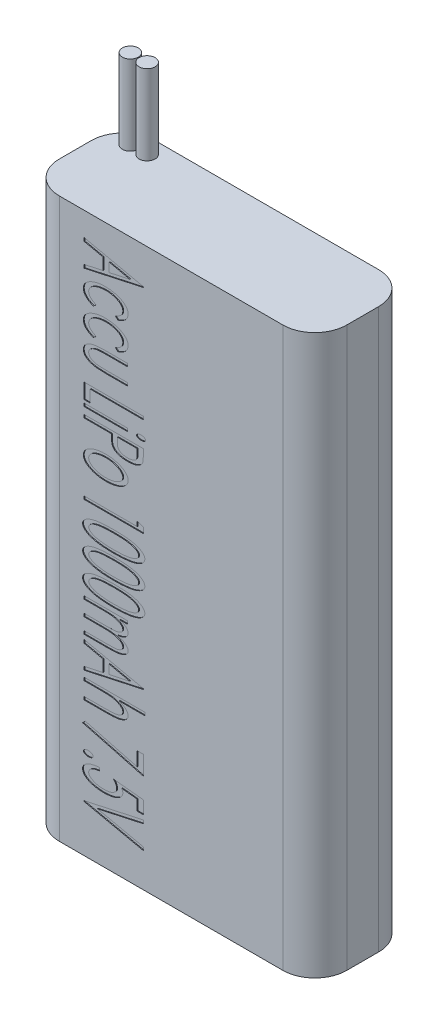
from build123d import *

# Parameters (mm, degrees)
EXTRUSION1_DEPTH        = 70
ESQUISSE2_W             = 5.413782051
ESQUISSE2_H             = 0.37991453
ENL_V_MAT_EXTRU_1_DEPTH = 0.1
ESQUISSE3_R             = 1
EXTRUSION2_DEPTH        = 10


with BuildPart() as part:
    # Esquisse1 → Extrusion1 (new body)
    with BuildSketch(Plane(origin=(0, 0, 0), x_dir=(1, 0, 0), z_dir=(0, 1, 0))):
        with BuildLine():
            Line((-14, 0), (14, 0))
            ThreePointArc((14, 0), (16.828427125, -1.171572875), (18, -4))
            Line((18, -4), (18, -8))
            ThreePointArc((18, -8), (16.828427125, -10.828427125), (14, -12))
            Line((14, -12), (-14, -12))
            ThreePointArc((-14, -12), (-16.828427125, -10.828427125), (-18, -8))
            Line((-18, -8), (-18, -4))
            ThreePointArc((-18, -4), (-16.828427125, -1.171572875), (-14, 0))
        make_face()
    extrude(amount=EXTRUSION1_DEPTH)

    # Esquisse2 → Enl_v. mat.-Extru.1 (cut)
    # profile 1 of 20: a face of its own
    with BuildSketch(Plane.XY.offset(12)):
        Polygon((-3.479233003, 65.32652701), (-10.887566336, 63.711890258), (-10.887566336, 64.122969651), (-8.513100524, 64.640900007), (-8.513100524, 66.107132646), (-10.887566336, 66.625063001), (-10.887566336, 67.036142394), (-3.479233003, 65.421505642), align=None)
        Polygon((-5.147295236, 65.374016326), (-7.753271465, 65.94240408), (-7.753271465, 64.805628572), align=None, mode=Mode.SUBTRACT)
    # profile 2 of 20: a face of its own
    with BuildSketch(Plane.XY.offset(12)):
        with BuildLine():
            Line((-6.647660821, 60.197680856), (-6.993442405, 60.485584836))
            add(Edge.make_bspline(
                [(-6.993442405, 60.485584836), (-6.918655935, 60.516454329), (-6.776324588, 60.575204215), (-6.581908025, 60.679160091), (-6.416645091, 60.791630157), (-6.281450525, 60.913754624), (-6.174584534, 61.044132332), (-6.098916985, 61.184519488), (-6.052021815, 61.33397975), (-6.046453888, 61.437020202), (-6.04365608, 61.488796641)],
                knots=[0, 0, 0, 0, 1.318688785, 2.509688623, 3.588184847, 4.570308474, 5.471048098, 6.322777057, 7.157218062, 8, 8, 8, 8], degree=3))
            add(Edge.make_bspline(
                [(-6.04365608, 61.488796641), (-6.045871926, 61.530485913), (-6.050249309, 61.612842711), (-6.07866726, 61.733791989), (-6.129580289, 61.847446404), (-6.196392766, 61.957552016), (-6.286106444, 62.060021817), (-6.393316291, 62.157756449), (-6.519374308, 62.250726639), (-6.664050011, 62.334665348), (-6.821509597, 62.413016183), (-6.989368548, 62.480922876), (-7.165322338, 62.538987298), (-7.34913708, 62.586758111), (-7.541796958, 62.621341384), (-7.742196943, 62.649025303), (-7.951442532, 62.662963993), (-8.093595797, 62.665723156), (-8.165834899, 62.6671253)],
                knots=[0, 0, 0, 0, 0.753257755, 1.488054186, 2.228480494, 2.994823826, 3.8061171, 4.678959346, 5.611944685, 6.629593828, 7.696658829, 8.786933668, 9.89752819, 11.041943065, 12.2145172, 13.431604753, 14.69479912, 16, 16, 16, 16], degree=3))
            add(Edge.make_bspline(
                [(-8.165834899, 62.6671253), (-8.260412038, 62.665760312), (-8.44708364, 62.663066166), (-8.722621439, 62.631249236), (-8.990414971, 62.585303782), (-9.245879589, 62.517384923), (-9.48320665, 62.433807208), (-9.697330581, 62.337708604), (-9.881376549, 62.222477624), (-10.036642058, 62.095309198), (-10.16237377, 61.957629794), (-10.251889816, 61.808472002), (-10.307363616, 61.649905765), (-10.314241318, 61.540673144), (-10.317694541, 61.485828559)],
                knots=[0, 0, 0, 0, 1.267897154, 2.502511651, 3.715525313, 4.909665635, 6.042860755, 7.087836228, 8.050656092, 8.946052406, 9.773106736, 10.537766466, 11.265827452, 12, 12, 12, 12], degree=3))
            add(Edge.make_bspline(
                [(-10.317694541, 61.485828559), (-10.314902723, 61.435525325), (-10.309344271, 61.335372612), (-10.262134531, 61.189888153), (-10.185868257, 61.052576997), (-10.080039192, 60.922547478), (-9.944302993, 60.80057516), (-9.779275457, 60.686572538), (-9.584922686, 60.579708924), (-9.442680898, 60.51801544), (-9.367908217, 60.485584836)],
                knots=[0, 0, 0, 0, 0.822732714, 1.638044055, 2.479727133, 3.384906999, 4.371872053, 5.460313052, 6.664954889, 8, 8, 8, 8], degree=3))
            Line((-9.367908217, 60.485584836), (-9.732982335, 60.197680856))
            add(Edge.make_bspline(
                [(-9.732982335, 60.197680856), (-9.827325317, 60.231749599), (-10.008509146, 60.297177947), (-10.256963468, 60.424491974), (-10.472573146, 60.568580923), (-10.65537162, 60.728428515), (-10.801825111, 60.90378874), (-10.906619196, 61.093976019), (-10.970628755, 61.297271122), (-10.978549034, 61.437394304), (-10.982544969, 61.508089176)],
                knots=[0, 0, 0, 0, 1.24214492, 2.385514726, 3.449959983, 4.448882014, 5.385367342, 6.266089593, 7.125208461, 8, 8, 8, 8], degree=3))
            add(Edge.make_bspline(
                [(-10.982544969, 61.508089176), (-10.980566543, 61.562263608), (-10.976630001, 61.670056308), (-10.935501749, 61.827085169), (-10.873067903, 61.977606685), (-10.783795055, 62.119971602), (-10.668969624, 62.254319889), (-10.529934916, 62.382241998), (-10.365276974, 62.50239941), (-10.177878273, 62.613389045), (-9.972982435, 62.715080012), (-9.754903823, 62.803315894), (-9.526802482, 62.880239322), (-9.286751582, 62.939821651), (-9.036821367, 62.989362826), (-8.775576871, 63.023337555), (-8.503982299, 63.042143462), (-8.319214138, 63.045388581), (-8.225196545, 63.04703983)],
                knots=[0, 0, 0, 0, 0.750373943, 1.493044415, 2.23771153, 3.005504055, 3.814258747, 4.683928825, 5.621819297, 6.637965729, 7.703410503, 8.793500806, 9.900774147, 11.041430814, 12.223647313, 13.435476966, 14.695065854, 16, 16, 16, 16], degree=3))
            add(Edge.make_bspline(
                [(-8.225196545, 63.04703983), (-8.098483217, 63.044232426), (-7.84896256, 63.038704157), (-7.481009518, 63.00220992), (-7.127642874, 62.935968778), (-6.791445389, 62.848411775), (-6.479610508, 62.739330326), (-6.200996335, 62.607450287), (-5.957345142, 62.457485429), (-5.782762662, 62.314276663), (-5.663628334, 62.191902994), (-5.587427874, 62.098151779), (-5.52346404, 62.001615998), (-5.470787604, 61.902237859), (-5.428659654, 61.80064828), (-5.401295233, 61.695640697), (-5.381909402, 61.588940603), (-5.379850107, 61.516588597), (-5.378805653, 61.479892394)],
                knots=[0, 0, 0, 0, 1.711411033, 3.370067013, 4.987107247, 6.562254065, 8.058366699, 9.442010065, 10.717465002, 11.9133582, 12.480344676, 13.021882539, 13.542577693, 14.041694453, 14.539198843, 15.023795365, 15.504878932, 16, 16, 16, 16], degree=3))
            add(Edge.make_bspline(
                [(-5.378805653, 61.479892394), (-5.380742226, 61.433690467), (-5.384618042, 61.341222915), (-5.418283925, 61.204675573), (-5.46804781, 61.069536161), (-5.542118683, 60.940212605), (-5.630337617, 60.816572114), (-5.732293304, 60.701158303), (-5.846753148, 60.595882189), (-5.974368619, 60.499719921), (-6.117568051, 60.413397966), (-6.277000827, 60.332817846), (-6.455607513, 60.260687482), (-6.58210097, 60.219188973), (-6.647660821, 60.197680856)],
                knots=[0, 0, 0, 0, 0.860282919, 1.72175189, 2.609200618, 3.538290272, 4.490491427, 5.43807946, 6.404208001, 7.38567114, 8.412385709, 9.517951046, 10.713587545, 12, 12, 12, 12], degree=3))
        make_face()
    # profile 3 of 20: a face of its own
    with BuildSketch(Plane.XY.offset(12)):
        with BuildLine():
            Line((-6.647660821, 56.778450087), (-6.993442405, 57.066354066))
            add(Edge.make_bspline(
                [(-6.993442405, 57.066354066), (-6.918655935, 57.09722356), (-6.776324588, 57.155973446), (-6.581908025, 57.259929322), (-6.416645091, 57.372399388), (-6.281450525, 57.494523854), (-6.174584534, 57.624901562), (-6.098916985, 57.765288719), (-6.052021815, 57.91474898), (-6.046453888, 58.017789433), (-6.04365608, 58.069565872)],
                knots=[0, 0, 0, 0, 1.318688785, 2.509688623, 3.588184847, 4.570308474, 5.471048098, 6.322777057, 7.157218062, 8, 8, 8, 8], degree=3))
            add(Edge.make_bspline(
                [(-6.04365608, 58.069565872), (-6.045871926, 58.111255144), (-6.050249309, 58.193611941), (-6.07866726, 58.31456122), (-6.129580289, 58.428215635), (-6.196392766, 58.538321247), (-6.286106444, 58.640791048), (-6.393316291, 58.738525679), (-6.519374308, 58.83149587), (-6.664050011, 58.915434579), (-6.821509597, 58.993785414), (-6.989368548, 59.061692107), (-7.165322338, 59.119756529), (-7.34913708, 59.167527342), (-7.541796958, 59.202110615), (-7.742196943, 59.229794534), (-7.951442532, 59.243733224), (-8.093595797, 59.246492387), (-8.165834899, 59.247894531)],
                knots=[0, 0, 0, 0, 0.753257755, 1.488054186, 2.228480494, 2.994823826, 3.8061171, 4.678959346, 5.611944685, 6.629593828, 7.696658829, 8.786933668, 9.89752819, 11.041943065, 12.2145172, 13.431604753, 14.69479912, 16, 16, 16, 16], degree=3))
            add(Edge.make_bspline(
                [(-8.165834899, 59.247894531), (-8.260412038, 59.246529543), (-8.44708364, 59.243835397), (-8.722621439, 59.212018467), (-8.990414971, 59.166073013), (-9.245879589, 59.098154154), (-9.48320665, 59.014576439), (-9.697330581, 58.918477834), (-9.881376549, 58.803246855), (-10.036642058, 58.676078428), (-10.16237377, 58.538399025), (-10.251889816, 58.389241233), (-10.307363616, 58.230674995), (-10.314241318, 58.121442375), (-10.317694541, 58.06659779)],
                knots=[0, 0, 0, 0, 1.267897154, 2.502511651, 3.715525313, 4.909665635, 6.042860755, 7.087836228, 8.050656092, 8.946052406, 9.773106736, 10.537766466, 11.265827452, 12, 12, 12, 12], degree=3))
            add(Edge.make_bspline(
                [(-10.317694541, 58.06659779), (-10.314902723, 58.016294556), (-10.309344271, 57.916141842), (-10.262134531, 57.770657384), (-10.185868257, 57.633346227), (-10.080039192, 57.503316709), (-9.944302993, 57.38134439), (-9.779275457, 57.267341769), (-9.584922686, 57.160478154), (-9.442680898, 57.098784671), (-9.367908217, 57.066354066)],
                knots=[0, 0, 0, 0, 0.822732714, 1.638044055, 2.479727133, 3.384906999, 4.371872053, 5.460313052, 6.664954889, 8, 8, 8, 8], degree=3))
            Line((-9.367908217, 57.066354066), (-9.732982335, 56.778450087))
            add(Edge.make_bspline(
                [(-9.732982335, 56.778450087), (-9.827325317, 56.81251883), (-10.008509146, 56.877947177), (-10.256963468, 57.005261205), (-10.472573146, 57.149350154), (-10.65537162, 57.309197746), (-10.801825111, 57.484557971), (-10.906619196, 57.674745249), (-10.970628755, 57.878040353), (-10.978549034, 58.018163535), (-10.982544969, 58.088858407)],
                knots=[0, 0, 0, 0, 1.24214492, 2.385514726, 3.449959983, 4.448882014, 5.385367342, 6.266089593, 7.125208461, 8, 8, 8, 8], degree=3))
            add(Edge.make_bspline(
                [(-10.982544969, 58.088858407), (-10.980566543, 58.143032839), (-10.976630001, 58.250825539), (-10.935501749, 58.4078544), (-10.873067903, 58.558375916), (-10.783795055, 58.700740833), (-10.668969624, 58.83508912), (-10.529934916, 58.963011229), (-10.365276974, 59.083168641), (-10.177878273, 59.194158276), (-9.972982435, 59.295849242), (-9.754903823, 59.384085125), (-9.526802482, 59.461008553), (-9.286751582, 59.520590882), (-9.036821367, 59.570132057), (-8.775576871, 59.604106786), (-8.503982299, 59.622912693), (-8.319214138, 59.626157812), (-8.225196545, 59.627809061)],
                knots=[0, 0, 0, 0, 0.750373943, 1.493044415, 2.23771153, 3.005504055, 3.814258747, 4.683928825, 5.621819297, 6.637965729, 7.703410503, 8.793500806, 9.900774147, 11.041430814, 12.223647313, 13.435476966, 14.695065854, 16, 16, 16, 16], degree=3))
            add(Edge.make_bspline(
                [(-8.225196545, 59.627809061), (-8.098483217, 59.625001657), (-7.84896256, 59.619473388), (-7.481009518, 59.582979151), (-7.127642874, 59.516738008), (-6.791445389, 59.429181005), (-6.479610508, 59.320099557), (-6.200996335, 59.188219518), (-5.957345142, 59.03825466), (-5.782762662, 58.895045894), (-5.663628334, 58.772672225), (-5.587427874, 58.67892101), (-5.52346404, 58.582385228), (-5.470787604, 58.48300709), (-5.428659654, 58.381417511), (-5.401295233, 58.276409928), (-5.381909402, 58.169709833), (-5.379850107, 58.097357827), (-5.378805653, 58.060661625)],
                knots=[0, 0, 0, 0, 1.711411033, 3.370067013, 4.987107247, 6.562254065, 8.058366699, 9.442010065, 10.717465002, 11.9133582, 12.480344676, 13.021882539, 13.542577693, 14.041694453, 14.539198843, 15.023795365, 15.504878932, 16, 16, 16, 16], degree=3))
            add(Edge.make_bspline(
                [(-5.378805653, 58.060661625), (-5.380742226, 58.014459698), (-5.384618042, 57.921992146), (-5.418283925, 57.785444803), (-5.46804781, 57.650305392), (-5.542118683, 57.520981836), (-5.630337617, 57.397341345), (-5.732293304, 57.281927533), (-5.846753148, 57.17665142), (-5.974368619, 57.080489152), (-6.117568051, 56.994167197), (-6.277000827, 56.913587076), (-6.455607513, 56.841456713), (-6.58210097, 56.799958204), (-6.647660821, 56.778450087)],
                knots=[0, 0, 0, 0, 0.860282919, 1.72175189, 2.609200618, 3.538290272, 4.490491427, 5.43807946, 6.404208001, 7.38567114, 8.412385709, 9.517951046, 10.713587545, 12, 12, 12, 12], degree=3))
        make_face()
    # profile 4 of 20: a face of its own
    with BuildSketch(Plane.XY.offset(12)):
        with BuildLine():
            Line((-5.473784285, 56.113599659), (-5.473784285, 55.73368513))
            Line((-5.473784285, 55.73368513), (-7.984781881, 55.73368513))
            add(Edge.make_bspline(
                [(-7.984781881, 55.73368513), (-8.058487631, 55.73310273), (-8.19946873, 55.731988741), (-8.402325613, 55.731771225), (-8.587295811, 55.726038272), (-8.75458287, 55.722969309), (-8.9039651, 55.714983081), (-9.035096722, 55.706451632), (-9.148960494, 55.696391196), (-9.218537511, 55.687386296), (-9.250668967, 55.683227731)],
                knots=[0, 0, 0, 0, 1.395453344, 2.66916147, 3.840154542, 4.898800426, 5.836495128, 6.671894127, 7.386665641, 8, 8, 8, 8], degree=3))
            add(Edge.make_bspline(
                [(-9.250668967, 55.683227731), (-9.329166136, 55.668938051), (-9.478976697, 55.641666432), (-9.689284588, 55.578194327), (-9.872899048, 55.495185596), (-10.029648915, 55.39667111), (-10.156922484, 55.283885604), (-10.249920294, 55.158117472), (-10.307753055, 55.019550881), (-10.314371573, 54.922933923), (-10.317694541, 54.874425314)],
                knots=[0, 0, 0, 0, 1.317153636, 2.513766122, 3.617996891, 4.635678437, 5.561222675, 6.409424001, 7.201417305, 8, 8, 8, 8], degree=3))
            add(Edge.make_bspline(
                [(-10.317694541, 54.874425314), (-10.314241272, 54.825963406), (-10.30737619, 54.729621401), (-10.252198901, 54.591803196), (-10.161447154, 54.467815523), (-10.03737227, 54.359126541), (-9.887497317, 54.262534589), (-9.711577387, 54.186193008), (-9.516672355, 54.118617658), (-9.376781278, 54.091556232), (-9.304094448, 54.077495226)],
                knots=[0, 0, 0, 0, 0.830068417, 1.650171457, 2.508098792, 3.446144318, 4.46618376, 5.557020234, 6.73063773, 8, 8, 8, 8], degree=3))
            add(Edge.make_bspline(
                [(-9.304094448, 54.077495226), (-9.274429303, 54.073423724), (-9.20828678, 54.064345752), (-9.098039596, 54.052093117), (-8.965791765, 54.044180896), (-8.811445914, 54.036654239), (-8.635311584, 54.031091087), (-8.437441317, 54.026128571), (-8.218268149, 54.025724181), (-8.064919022, 54.02463758), (-7.984781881, 54.024069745)],
                knots=[0, 0, 0, 0, 0.543859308, 1.212609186, 2.01407225, 2.949571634, 4.019367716, 5.214651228, 6.544433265, 8, 8, 8, 8], degree=3))
            Line((-7.984781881, 54.024069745), (-5.473784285, 54.024069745))
            Line((-5.473784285, 54.024069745), (-5.473784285, 53.644155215))
            Line((-5.473784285, 53.644155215), (-8.109441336, 53.644155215))
            add(Edge.make_bspline(
                [(-8.109441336, 53.644155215), (-8.198987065, 53.644122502), (-8.372671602, 53.64405905), (-8.624952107, 53.652617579), (-8.860033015, 53.661995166), (-9.078236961, 53.677111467), (-9.278770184, 53.69556723), (-9.462211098, 53.720068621), (-9.628981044, 53.745351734), (-9.823845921, 53.788436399), (-10.043071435, 53.851708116), (-10.280949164, 53.943724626), (-10.487607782, 54.055798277), (-10.637842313, 54.163047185), (-10.740002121, 54.258337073), (-10.804976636, 54.333260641), (-10.859596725, 54.413566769), (-10.903476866, 54.498062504), (-10.94007563, 54.586127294), (-10.965080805, 54.678880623), (-10.980439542, 54.775958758), (-10.98183516, 54.842212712), (-10.982544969, 54.875909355)],
                knots=[0, 0, 0, 0, 1.559821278, 3.025457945, 4.396994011, 5.65812099, 6.835465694, 7.90436892, 8.881932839, 9.772726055, 11.379059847, 12.852907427, 14.20642971, 15.464726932, 16.056089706, 16.636552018, 17.188688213, 17.743775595, 18.292674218, 18.84669026, 19.41342873, 20, 20, 20, 20], degree=3))
            add(Edge.make_bspline(
                [(-10.982544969, 54.875909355), (-10.981848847, 54.909609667), (-10.980480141, 54.975870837), (-10.964850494, 55.073369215), (-10.940374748, 55.166763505), (-10.903449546, 55.255236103), (-10.859589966, 55.339722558), (-10.8050316, 55.420100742), (-10.739550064, 55.494987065), (-10.638398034, 55.592234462), (-10.487260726, 55.700637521), (-10.279465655, 55.814618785), (-10.03848057, 55.905860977), (-9.816905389, 55.969305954), (-9.61959167, 56.012518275), (-9.4493699, 56.037905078), (-9.261911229, 56.061909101), (-9.055993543, 56.08090375), (-8.8328103, 56.095590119), (-8.591317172, 56.105231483), (-8.332105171, 56.113686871), (-8.152981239, 56.113629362), (-8.060467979, 56.113599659)],
                knots=[0, 0, 0, 0, 0.577788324, 1.136040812, 1.689952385, 2.230632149, 2.777408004, 3.321276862, 3.893047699, 4.481402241, 5.725877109, 7.070648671, 8.538224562, 10.136816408, 11.02256744, 12.002259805, 13.088837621, 14.265454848, 15.550045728, 16.926486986, 18.412603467, 20, 20, 20, 20], degree=3))
            Line((-8.060467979, 56.113599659), (-5.473784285, 56.113599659))
        make_face()
    # profile 5 of 20: a face of its own
    with BuildSketch(Plane.XY.offset(12)):
        Polygon((-3.479233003, 51.364668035), (-3.479233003, 50.984753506), (-10.127737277, 50.984753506), (-10.127737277, 49.465095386), (-10.887566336, 49.465095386), (-10.887566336, 51.364668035), align=None)
    # profile 6 of 20: a face of its own
    with BuildSketch(Plane.XY.offset(12)):
        with BuildLine():
            add(Edge.make_bspline(
                [(-3.194297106, 48.896707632), (-3.196270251, 48.876953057), (-3.200275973, 48.836848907), (-3.236313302, 48.781577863), (-3.291353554, 48.73358127), (-3.36363949, 48.689652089), (-3.451261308, 48.655477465), (-3.54859257, 48.62835276), (-3.655433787, 48.614228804), (-3.729012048, 48.611632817), (-3.767136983, 48.610287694)],
                knots=[0, 0, 0, 0, 0.677840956, 1.376098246, 2.211551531, 3.194432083, 4.284065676, 5.454375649, 6.68097232, 8, 8, 8, 8], degree=3))
            add(Edge.make_bspline(
                [(-3.767136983, 48.610287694), (-3.804270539, 48.611655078), (-3.876364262, 48.614309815), (-3.981266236, 48.628302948), (-4.077492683, 48.655753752), (-4.164705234, 48.689628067), (-4.236982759, 48.733586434), (-4.292024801, 48.781576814), (-4.328061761, 48.836849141), (-4.332067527, 48.876953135), (-4.334040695, 48.896707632)],
                knots=[0, 0, 0, 0, 1.295810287, 2.515778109, 3.679425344, 4.778344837, 5.769601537, 6.61217459, 7.316382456, 8, 8, 8, 8], degree=3))
            add(Edge.make_bspline(
                [(-4.334040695, 48.896707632), (-4.331977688, 48.915934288), (-4.327735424, 48.955471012), (-4.292400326, 49.010237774), (-4.236818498, 49.056948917), (-4.163962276, 49.098774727), (-4.077929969, 49.135232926), (-3.98119331, 49.161974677), (-3.876384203, 49.176183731), (-3.804277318, 49.178807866), (-3.767136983, 49.180159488)],
                knots=[0, 0, 0, 0, 0.669220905, 1.376152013, 2.210377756, 3.196534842, 4.30634595, 5.474493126, 6.699178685, 8, 8, 8, 8], degree=3))
            add(Edge.make_bspline(
                [(-3.767136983, 49.180159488), (-3.729005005, 49.178830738), (-3.655413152, 49.176266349), (-3.548666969, 49.161921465), (-3.450819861, 49.135519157), (-3.364381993, 49.098751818), (-3.29151793, 49.05695378), (-3.235937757, 49.010236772), (-3.200602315, 48.95547123), (-3.196360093, 48.91593436), (-3.194297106, 48.896707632)],
                knots=[0, 0, 0, 0, 1.324085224, 2.555385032, 3.730182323, 4.830579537, 5.808371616, 6.635521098, 7.336455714, 8, 8, 8, 8], degree=3))
        make_face()
    # profile 7 of 20: a face of its own
    with BuildSketch(Plane.XY.offset(12)):
        with Locations((-8.18067531, 48.895223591)):
            Rectangle(ESQUISSE2_W, ESQUISSE2_H)
    # profile 8 of 20: a face of its own
    with BuildSketch(Plane.XY.offset(12)):
        with BuildLine():
            Line((-3.479233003, 47.850458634), (-3.479233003, 47.093597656))
            add(Edge.make_bspline(
                [(-3.479233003, 47.093597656), (-3.479351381, 47.041648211), (-3.479579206, 46.941668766), (-3.485891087, 46.798672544), (-3.494430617, 46.668978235), (-3.506440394, 46.552688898), (-3.520256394, 46.448897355), (-3.539704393, 46.358824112), (-3.560954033, 46.281248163), (-3.581116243, 46.23612635), (-3.590536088, 46.215045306)],
                knots=[0, 0, 0, 0, 1.398759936, 2.691987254, 3.853659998, 4.898142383, 5.840073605, 6.670897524, 7.379039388, 8, 8, 8, 8], degree=3))
            add(Edge.make_bspline(
                [(-3.590536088, 46.215045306), (-3.60471127, 46.187931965), (-3.633344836, 46.133163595), (-3.689312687, 46.057277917), (-3.755415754, 45.985624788), (-3.831629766, 45.917344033), (-3.917681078, 45.851832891), (-4.015082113, 45.791351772), (-4.121831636, 45.733221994), (-4.281539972, 45.661085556), (-4.502994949, 45.583806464), (-4.796641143, 45.521819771), (-5.121032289, 45.483094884), (-5.348016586, 45.478426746), (-5.466364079, 45.475992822)],
                knots=[0, 0, 0, 0, 0.521432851, 1.053283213, 1.602921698, 2.182653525, 2.797168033, 3.445863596, 4.137047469, 4.869860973, 6.434205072, 8.127989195, 9.981169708, 12, 12, 12, 12], degree=3))
            add(Edge.make_bspline(
                [(-5.466364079, 45.475992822), (-5.585170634, 45.478637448), (-5.812524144, 45.483698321), (-6.137826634, 45.519495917), (-6.429958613, 45.583509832), (-6.652002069, 45.655634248), (-6.809226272, 45.729620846), (-6.916971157, 45.784966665), (-7.013981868, 45.847469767), (-7.099737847, 45.915871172), (-7.176343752, 45.98769439), (-7.24404664, 46.063385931), (-7.300704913, 46.145539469), (-7.331377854, 46.203837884), (-7.346644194, 46.232853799)],
                knots=[0, 0, 0, 0, 2.009965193, 3.846358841, 5.525688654, 7.063326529, 7.782279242, 8.463618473, 9.111281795, 9.730811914, 10.316938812, 10.886152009, 11.445622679, 12, 12, 12, 12], degree=3))
            add(Edge.make_bspline(
                [(-7.346644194, 46.232853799), (-7.356490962, 46.256436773), (-7.377866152, 46.307630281), (-7.40209903, 46.393773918), (-7.422883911, 46.493927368), (-7.438305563, 46.608069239), (-7.451565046, 46.735759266), (-7.462113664, 46.877272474), (-7.467883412, 47.033197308), (-7.468180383, 47.142071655), (-7.468335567, 47.198964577)],
                knots=[0, 0, 0, 0, 0.625646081, 1.358141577, 2.187676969, 3.130342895, 4.178300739, 5.332762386, 6.606219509, 8, 8, 8, 8], degree=3))
            Line((-7.468335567, 47.198964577), (-7.468335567, 47.470544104))
            Line((-7.468335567, 47.470544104), (-10.887566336, 47.470544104))
            Line((-10.887566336, 47.470544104), (-10.887566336, 47.850458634))
            Line((-10.887566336, 47.850458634), (-3.479233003, 47.850458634))
        make_face()
        with BuildLine():
            Line((-4.239062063, 47.470544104), (-6.708506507, 47.470544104))
            Line((-6.708506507, 47.470544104), (-6.72483096, 46.822018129))
            add(Edge.make_bspline(
                [(-6.72483096, 46.822018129), (-6.723351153, 46.76055602), (-6.72060345, 46.646433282), (-6.695119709, 46.487887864), (-6.656275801, 46.354028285), (-6.594174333, 46.244136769), (-6.510939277, 46.15567277), (-6.410108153, 46.077483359), (-6.287193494, 46.011739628), (-6.145974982, 45.956359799), (-5.991185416, 45.910453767), (-5.824334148, 45.880868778), (-5.650010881, 45.858216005), (-5.530257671, 45.856685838), (-5.469332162, 45.855907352)],
                knots=[0, 0, 0, 0, 1.212185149, 2.250783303, 3.161794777, 3.949014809, 4.716177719, 5.544300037, 6.457610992, 7.456672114, 8.535037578, 9.638096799, 10.798360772, 12, 12, 12, 12], degree=3))
            add(Edge.make_bspline(
                [(-5.469332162, 45.855907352), (-5.40988897, 45.856696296), (-5.292599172, 45.858252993), (-5.12126917, 45.881010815), (-4.956348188, 45.910407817), (-4.802666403, 45.95660774), (-4.663108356, 46.011341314), (-4.542419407, 46.07517953), (-4.442728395, 46.147153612), (-4.363852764, 46.232815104), (-4.305092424, 46.337587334), (-4.267169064, 46.466654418), (-4.241448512, 46.621149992), (-4.239897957, 46.733340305), (-4.239062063, 46.793821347)],
                knots=[0, 0, 0, 0, 1.199910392, 2.367592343, 3.486753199, 4.580869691, 5.603406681, 6.511074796, 7.332566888, 8.075402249, 8.845176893, 9.736467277, 10.779744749, 12, 12, 12, 12], degree=3))
            Line((-4.239062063, 46.793821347), (-4.239062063, 47.470544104))
        make_face(mode=Mode.SUBTRACT)
    # profile 9 of 20: a face of its own
    with BuildSketch(Plane.XY.offset(12)):
        with BuildLine():
            add(Edge.make_bspline(
                [(-5.378805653, 43.432468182), (-5.381087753, 43.379223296), (-5.385644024, 43.272918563), (-5.431616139, 43.118379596), (-5.50215624, 42.971066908), (-5.600915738, 42.830711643), (-5.72862385, 42.699180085), (-5.883177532, 42.573962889), (-6.065794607, 42.456533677), (-6.200297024, 42.387977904), (-6.270714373, 42.352086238)],
                knots=[0, 0, 0, 0, 0.86112124, 1.719249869, 2.590875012, 3.500801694, 4.487759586, 5.553635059, 6.719230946, 8, 8, 8, 8], degree=3))
            add(Edge.make_bspline(
                [(-6.270714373, 42.352086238), (-6.339518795, 42.32032611), (-6.478542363, 42.256152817), (-6.697151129, 42.179287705), (-6.923812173, 42.111620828), (-7.160284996, 42.056971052), (-7.4060678, 42.01441682), (-7.661063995, 41.9827822), (-7.925167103, 41.965193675), (-8.104469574, 41.962931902), (-8.195515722, 41.96178342)],
                knots=[0, 0, 0, 0, 0.91795664, 1.854787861, 2.805160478, 3.783872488, 4.794154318, 5.827041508, 6.896615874, 8, 8, 8, 8], degree=3))
            add(Edge.make_bspline(
                [(-8.195515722, 41.96178342), (-8.287064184, 41.962792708), (-8.467404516, 41.964780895), (-8.733463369, 41.98440513), (-8.990899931, 42.017462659), (-9.239889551, 42.061023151), (-9.48018215, 42.119392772), (-9.711092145, 42.190353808), (-9.933732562, 42.273875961), (-10.144829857, 42.368728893), (-10.339309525, 42.473441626), (-10.509895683, 42.58815287), (-10.655601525, 42.709355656), (-10.773807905, 42.839628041), (-10.868767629, 42.975811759), (-10.934253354, 43.121263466), (-10.974923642, 43.274449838), (-10.979979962, 43.379286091), (-10.982544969, 43.432468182)],
                knots=[0, 0, 0, 0, 1.278164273, 2.517842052, 3.72244268, 4.901239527, 6.045490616, 7.172897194, 8.272386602, 9.363687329, 10.402278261, 11.352514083, 12.229860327, 13.041587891, 13.8021844, 14.537909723, 15.258300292, 16, 16, 16, 16], degree=3))
            add(Edge.make_bspline(
                [(-10.982544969, 43.432468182), (-10.97992331, 43.485634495), (-10.974731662, 43.590919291), (-10.934617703, 43.744783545), (-10.868325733, 43.890820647), (-10.77428569, 44.028073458), (-10.65598992, 44.158558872), (-10.509370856, 44.278128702), (-10.339376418, 44.393039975), (-10.144863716, 44.497823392), (-9.933351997, 44.591988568), (-9.711757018, 44.678547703), (-9.479601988, 44.745955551), (-9.24019184, 44.807565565), (-8.990848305, 44.850246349), (-8.733477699, 44.883553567), (-8.467400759, 44.90310933), (-8.287062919, 44.90510695), (-8.195515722, 44.906121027)],
                knots=[0, 0, 0, 0, 0.741234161, 1.46785969, 2.203123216, 2.968956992, 3.780175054, 4.652530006, 5.602169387, 6.640108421, 7.730724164, 8.83197098, 9.956659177, 11.101836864, 12.279893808, 13.483738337, 14.722638, 16, 16, 16, 16], degree=3))
            add(Edge.make_bspline(
                [(-8.195515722, 44.906121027), (-8.104964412, 44.904964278), (-7.92615703, 44.902680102), (-7.662549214, 44.885108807), (-7.408031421, 44.853596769), (-7.163217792, 44.811016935), (-6.927426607, 44.755741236), (-6.700901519, 44.689248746), (-6.482635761, 44.611371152), (-6.343992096, 44.547516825), (-6.275166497, 44.515818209)],
                knots=[0, 0, 0, 0, 1.099813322, 2.17174928, 3.206917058, 4.213511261, 5.18853308, 6.146766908, 7.080016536, 8, 8, 8, 8], degree=3))
            add(Edge.make_bspline(
                [(-6.275166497, 44.515818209), (-6.204192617, 44.480025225), (-6.068982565, 44.411837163), (-5.886098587, 44.293387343), (-5.730140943, 44.169271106), (-5.602111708, 44.036534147), (-5.502370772, 43.896043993), (-5.431637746, 43.748024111), (-5.385496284, 43.593027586), (-5.381045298, 43.486214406), (-5.378805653, 43.432468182)],
                knots=[0, 0, 0, 0, 1.282648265, 2.443531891, 3.511299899, 4.494267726, 5.41164008, 6.279741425, 7.134400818, 8, 8, 8, 8], degree=3))
        make_face()
        with BuildLine():
            add(Edge.make_bspline(
                [(-6.04365608, 43.433952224), (-6.045763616, 43.470755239), (-6.049989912, 43.544557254), (-6.081123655, 43.65263921), (-6.130945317, 43.756288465), (-6.200457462, 43.855652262), (-6.291410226, 43.948915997), (-6.400148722, 44.039680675), (-6.529475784, 44.125701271), (-6.675960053, 44.207286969), (-6.836543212, 44.282418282), (-7.007263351, 44.347580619), (-7.186016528, 44.401877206), (-7.37234309, 44.449265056), (-7.568095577, 44.481905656), (-7.771579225, 44.507029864), (-7.982993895, 44.524587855), (-8.1267187, 44.525660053), (-8.199967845, 44.526206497)],
                knots=[0, 0, 0, 0, 0.673132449, 1.349849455, 2.042497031, 2.771037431, 3.558905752, 4.420412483, 5.359790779, 6.397715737, 7.487520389, 8.602580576, 9.739779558, 10.90606597, 12.119462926, 13.369644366, 14.659442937, 16, 16, 16, 16], degree=3))
            add(Edge.make_bspline(
                [(-8.199967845, 44.526206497), (-8.294526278, 44.524674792), (-8.481109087, 44.521652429), (-8.755809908, 44.492364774), (-9.020646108, 44.446691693), (-9.272524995, 44.384136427), (-9.505002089, 44.304406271), (-9.714546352, 44.214504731), (-9.894044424, 44.106776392), (-10.044911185, 43.98877224), (-10.165743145, 43.861452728), (-10.252589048, 43.725217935), (-10.308753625, 43.582122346), (-10.314740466, 43.482907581), (-10.317694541, 43.433952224)],
                knots=[0, 0, 0, 0, 1.312767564, 2.590354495, 3.831574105, 5.042871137, 6.189932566, 7.241788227, 8.203159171, 9.088289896, 9.895184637, 10.627029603, 11.322537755, 12, 12, 12, 12], degree=3))
            add(Edge.make_bspline(
                [(-10.317694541, 43.433952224), (-10.314735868, 43.385000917), (-10.308739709, 43.285794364), (-10.252647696, 43.142634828), (-10.165303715, 43.006358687), (-10.045433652, 42.877695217), (-9.894379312, 42.759508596), (-9.714079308, 42.653711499), (-9.505073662, 42.563372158), (-9.2725039, 42.483805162), (-9.020652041, 42.421202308), (-8.755808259, 42.375542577), (-8.481109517, 42.346251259), (-8.294526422, 42.3432294), (-8.199967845, 42.34169795)],
                knots=[0, 0, 0, 0, 0.677376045, 1.3727957, 2.104547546, 2.91638239, 3.801400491, 4.75913322, 5.810855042, 6.957770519, 8.168913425, 9.409975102, 10.687399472, 12, 12, 12, 12], degree=3))
            add(Edge.make_bspline(
                [(-8.199967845, 42.34169795), (-8.126715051, 42.342226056), (-7.982983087, 42.343262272), (-7.771620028, 42.361079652), (-7.56786332, 42.385274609), (-7.372807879, 42.421263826), (-7.185457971, 42.464962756), (-7.007591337, 42.522404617), (-6.836491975, 42.586799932), (-6.675980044, 42.6621513), (-6.529447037, 42.743652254), (-6.400232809, 42.829790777), (-6.290859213, 42.920437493), (-6.200870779, 43.015140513), (-6.131311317, 43.11424708), (-6.081112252, 43.216688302), (-6.049854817, 43.323805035), (-6.045727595, 43.397142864), (-6.04365608, 43.433952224)],
                knots=[0, 0, 0, 0, 1.341240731, 2.631697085, 3.882516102, 5.098119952, 6.262853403, 7.403334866, 8.518963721, 9.60932416, 10.647778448, 11.587635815, 12.449581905, 13.244437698, 13.973349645, 14.658187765, 15.326524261, 16, 16, 16, 16], degree=3))
        make_face(mode=Mode.SUBTRACT)
    # profile 10 of 20: a face of its own
    with BuildSketch(Plane.XY.offset(12)):
        Polygon((-3.479233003, 39.370647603), (-3.479233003, 38.637531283), (-10.887566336, 38.637531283), (-10.887566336, 39.017445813), (-4.239062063, 39.017445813), (-4.239062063, 39.587317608), align=None)
    # profile 11 of 20: a face of its own
    with BuildSketch(Plane.XY.offset(12)):
        with BuildLine():
            add(Edge.make_bspline(
                [(-7.186367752, 37.212851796), (-7.06763952, 37.212222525), (-6.837085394, 37.211000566), (-6.501170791, 37.203283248), (-6.185941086, 37.192350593), (-5.891600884, 37.173997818), (-5.618331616, 37.152671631), (-5.366014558, 37.124197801), (-5.134332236, 37.092006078), (-4.921980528, 37.05481923), (-4.726064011, 37.012822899), (-4.543652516, 36.967574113), (-4.373862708, 36.915969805), (-4.21484996, 36.864413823), (-4.069544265, 36.803824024), (-3.935406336, 36.742685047), (-3.814349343, 36.674939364), (-3.704749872, 36.604728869), (-3.608142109, 36.529952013), (-3.523119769, 36.454766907), (-3.450649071, 36.377347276), (-3.392326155, 36.296301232), (-3.345756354, 36.213370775), (-3.312783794, 36.127973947), (-3.292270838, 36.040447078), (-3.290277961, 35.981208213), (-3.289275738, 35.951416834)],
                knots=[0, 0, 0, 0, 1.9498248, 3.786295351, 5.517924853, 7.129425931, 8.629198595, 10.018875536, 11.298758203, 12.470106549, 13.558387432, 14.588885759, 15.555333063, 16.472480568, 17.332396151, 18.13925172, 18.892025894, 19.608596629, 20.274813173, 20.896178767, 21.471090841, 22.012236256, 22.532234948, 23.028596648, 23.511478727, 24, 24, 24, 24], degree=3))
            add(Edge.make_bspline(
                [(-3.289275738, 35.951416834), (-3.290271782, 35.921128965), (-3.292252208, 35.860907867), (-3.312845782, 35.771965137), (-3.345271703, 35.685277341), (-3.393219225, 35.601706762), (-3.449979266, 35.518159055), (-3.523197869, 35.439295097), (-3.608146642, 35.361942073), (-3.706152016, 35.286871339), (-3.816486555, 35.213184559), (-3.941194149, 35.145912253), (-4.078349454, 35.082495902), (-4.227402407, 35.020670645), (-4.390533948, 34.965712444), (-4.565902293, 34.911567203), (-4.754666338, 34.863036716), (-4.957102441, 34.818454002), (-5.174893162, 34.77842319), (-5.409411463, 34.742721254), (-5.661865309, 34.713286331), (-5.93214436, 34.690235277), (-6.220550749, 34.6705379), (-6.526856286, 34.657583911), (-6.850939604, 34.650416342), (-7.07258768, 34.649102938), (-7.186367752, 34.648428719)],
                knots=[0, 0, 0, 0, 0.494963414, 0.98413135, 1.486391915, 2.004648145, 2.557189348, 3.136150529, 3.760862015, 4.436202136, 5.154810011, 5.930241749, 6.752492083, 7.627579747, 8.569870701, 9.568763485, 10.631199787, 11.758832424, 12.961004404, 14.254967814, 15.640910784, 17.120205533, 18.694500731, 20.372114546, 22.13767358, 24, 24, 24, 24], degree=3))
            add(Edge.make_bspline(
                [(-7.186367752, 34.648428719), (-7.299653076, 34.649103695), (-7.520311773, 34.650418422), (-7.84291257, 34.65757329), (-8.147730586, 34.670568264), (-8.434667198, 34.690119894), (-8.703359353, 34.713657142), (-8.954849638, 34.74146254), (-9.188610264, 34.774912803), (-9.405210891, 34.815658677), (-9.606291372, 34.859776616), (-9.793527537, 34.909560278), (-9.969567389, 34.960094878), (-10.131540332, 35.019150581), (-10.282959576, 35.076814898), (-10.419272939, 35.143355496), (-10.544609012, 35.210558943), (-10.656037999, 35.283431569), (-10.754587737, 35.35955346), (-10.840907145, 35.437160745), (-10.912596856, 35.518498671), (-10.973235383, 35.600093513), (-11.019642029, 35.685082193), (-11.052086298, 35.772125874), (-11.074995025, 35.860703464), (-11.076678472, 35.921097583), (-11.077523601, 35.951416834)],
                knots=[0, 0, 0, 0, 1.856919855, 3.61693378, 5.288880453, 6.857369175, 8.33073272, 9.709704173, 11.004351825, 12.200295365, 13.321647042, 14.377778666, 15.375784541, 16.322121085, 17.202968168, 18.029877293, 18.806433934, 19.532858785, 20.209178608, 20.846251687, 21.432088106, 21.983526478, 22.50964327, 23.012632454, 23.504318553, 24, 24, 24, 24], degree=3))
            add(Edge.make_bspline(
                [(-11.077523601, 35.951416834), (-11.076519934, 35.981207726), (-11.074524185, 36.040445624), (-11.054032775, 36.12797975), (-11.021218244, 36.212719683), (-10.975583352, 36.294985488), (-10.919309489, 36.376382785), (-10.846572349, 36.452686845), (-10.763678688, 36.528602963), (-10.667887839, 36.601685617), (-10.559233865, 36.670749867), (-10.438806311, 36.738207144), (-10.304336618, 36.799765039), (-10.158613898, 36.859262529), (-9.999572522, 36.912133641), (-9.829053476, 36.963090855), (-9.645005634, 37.008051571), (-9.447830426, 37.051919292), (-9.234097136, 37.090885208), (-9.000771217, 37.122705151), (-8.747391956, 37.150648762), (-8.474295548, 37.174520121), (-8.180845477, 37.192188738), (-7.867116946, 37.20333271), (-7.533175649, 37.210975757), (-7.304106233, 37.212214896), (-7.186367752, 37.212851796)],
                knots=[0, 0, 0, 0, 0.489206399, 0.972765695, 1.469823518, 1.979503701, 2.516685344, 3.092403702, 3.708601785, 4.364345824, 5.070673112, 5.824503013, 6.632490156, 7.50114929, 8.411876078, 9.387477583, 10.427311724, 11.526792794, 12.709225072, 13.998958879, 15.398670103, 16.901229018, 18.506869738, 20.23279814, 22.063710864, 24, 24, 24, 24], degree=3))
        make_face()
        with BuildLine():
            add(Edge.make_bspline(
                [(-7.18339967, 36.832937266), (-7.28233996, 36.832816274), (-7.474304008, 36.832581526), (-7.75331581, 36.826104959), (-8.013556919, 36.817618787), (-8.254976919, 36.805573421), (-8.47773799, 36.791555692), (-8.682011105, 36.771816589), (-8.867833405, 36.750689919), (-9.083819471, 36.714951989), (-9.325385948, 36.667900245), (-9.583113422, 36.591531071), (-9.805405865, 36.506641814), (-9.98715303, 36.403890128), (-10.131019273, 36.29546604), (-10.236434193, 36.183005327), (-10.304205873, 36.063871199), (-10.313322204, 35.97984487), (-10.317694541, 35.939544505)],
                knots=[0, 0, 0, 0, 1.373741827, 2.665335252, 3.874915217, 4.988988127, 6.021568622, 6.973635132, 7.838372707, 8.617530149, 10.013095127, 11.25192517, 12.346280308, 13.30899082, 14.141540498, 14.836901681, 15.442159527, 16, 16, 16, 16], degree=3))
            add(Edge.make_bspline(
                [(-10.317694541, 35.939544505), (-10.314130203, 35.898629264), (-10.306775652, 35.814205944), (-10.236663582, 35.696813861), (-10.137490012, 35.581866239), (-9.994105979, 35.476999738), (-9.814779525, 35.376405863), (-9.592949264, 35.293376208), (-9.333629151, 35.218424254), (-9.145699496, 35.183452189), (-9.045871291, 35.164875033)],
                knots=[0, 0, 0, 0, 0.612834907, 1.264505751, 2.016446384, 2.900971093, 3.927663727, 5.11513031, 6.467557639, 8, 8, 8, 8], degree=3))
            add(Edge.make_bspline(
                [(-9.045871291, 35.164875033), (-8.97966491, 35.153449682), (-8.84463964, 35.130148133), (-8.63597484, 35.10478688), (-8.418398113, 35.080455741), (-8.190752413, 35.061439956), (-7.953255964, 35.046482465), (-7.705337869, 35.036898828), (-7.447616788, 35.028316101), (-7.27245009, 35.028334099), (-7.18339967, 35.028343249)],
                knots=[0, 0, 0, 0, 0.862252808, 1.758530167, 2.697450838, 3.672457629, 4.690394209, 5.75172757, 6.857033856, 8, 8, 8, 8], degree=3))
            add(Edge.make_bspline(
                [(-7.18339967, 35.028343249), (-7.094354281, 35.028515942), (-6.920199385, 35.028853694), (-6.66538491, 35.034755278), (-6.422987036, 35.045406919), (-6.19293465, 35.058719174), (-5.975143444, 35.074461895), (-5.76975851, 35.095167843), (-5.576841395, 35.120554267), (-5.395758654, 35.148808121), (-5.22662873, 35.178823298), (-5.070289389, 35.215913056), (-4.924542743, 35.251364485), (-4.791397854, 35.293819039), (-4.669131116, 35.336103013), (-4.559041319, 35.382075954), (-4.460644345, 35.430792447), (-4.349449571, 35.49763457), (-4.236013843, 35.586342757), (-4.128410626, 35.696560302), (-4.063221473, 35.816726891), (-4.053669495, 35.89983082), (-4.049104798, 35.939544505)],
                knots=[0, 0, 0, 0, 1.545659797, 3.023000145, 4.423949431, 5.757155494, 7.022953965, 8.214023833, 9.339820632, 10.400046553, 11.395419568, 12.320293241, 13.188756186, 13.998111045, 14.744970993, 15.433903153, 16.06753011, 16.64922297, 17.683254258, 18.558356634, 19.31106784, 20, 20, 20, 20], degree=3))
            add(Edge.make_bspline(
                [(-4.049104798, 35.939544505), (-4.053534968, 35.980283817), (-4.062689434, 36.064467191), (-4.128480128, 36.185422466), (-4.235533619, 36.295853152), (-4.377991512, 36.40410423), (-4.559236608, 36.505071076), (-4.78038912, 36.590614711), (-5.038969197, 36.663879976), (-5.279825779, 36.713828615), (-5.496018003, 36.74910783), (-5.681321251, 36.770367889), (-5.885654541, 36.789744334), (-6.108781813, 36.806138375), (-6.350783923, 36.817370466), (-6.611499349, 36.826220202), (-6.891012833, 36.832555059), (-7.083965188, 36.832807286), (-7.18339967, 36.832937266)],
                knots=[0, 0, 0, 0, 0.564503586, 1.166485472, 1.866349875, 2.689115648, 3.642294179, 4.736447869, 5.973125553, 7.369835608, 8.148849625, 9.01342802, 9.958482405, 10.998201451, 12.118928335, 13.321422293, 14.619643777, 16, 16, 16, 16], degree=3))
        make_face(mode=Mode.SUBTRACT)
    # profile 12 of 20: a face of its own
    with BuildSketch(Plane.XY.offset(12)):
        with BuildLine():
            add(Edge.make_bspline(
                [(-7.186367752, 34.268514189), (-7.06763952, 34.267884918), (-6.837085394, 34.266662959), (-6.501170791, 34.258945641), (-6.185941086, 34.248012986), (-5.891600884, 34.229660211), (-5.618331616, 34.208334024), (-5.366014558, 34.179860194), (-5.134332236, 34.147668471), (-4.921980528, 34.110481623), (-4.726064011, 34.068485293), (-4.543652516, 34.023236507), (-4.373862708, 33.971632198), (-4.21484996, 33.920076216), (-4.069544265, 33.859486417), (-3.935406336, 33.79834744), (-3.814349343, 33.730601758), (-3.704749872, 33.660391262), (-3.608142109, 33.585614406), (-3.523119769, 33.5104293), (-3.450649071, 33.433009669), (-3.392326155, 33.351963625), (-3.345756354, 33.269033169), (-3.312783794, 33.18363634), (-3.292270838, 33.096109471), (-3.290277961, 33.036870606), (-3.289275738, 33.007079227)],
                knots=[0, 0, 0, 0, 1.9498248, 3.786295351, 5.517924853, 7.129425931, 8.629198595, 10.018875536, 11.298758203, 12.470106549, 13.558387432, 14.588885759, 15.555333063, 16.472480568, 17.332396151, 18.13925172, 18.892025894, 19.608596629, 20.274813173, 20.896178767, 21.471090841, 22.012236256, 22.532234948, 23.028596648, 23.511478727, 24, 24, 24, 24], degree=3))
            add(Edge.make_bspline(
                [(-3.289275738, 33.007079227), (-3.290271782, 32.976791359), (-3.292252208, 32.91657026), (-3.312845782, 32.82762753), (-3.345271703, 32.740939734), (-3.393219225, 32.657369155), (-3.449979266, 32.573821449), (-3.523197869, 32.494957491), (-3.608146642, 32.417604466), (-3.706152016, 32.342533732), (-3.816486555, 32.268846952), (-3.941194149, 32.201574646), (-4.078349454, 32.138158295), (-4.227402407, 32.076333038), (-4.390533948, 32.021374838), (-4.565902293, 31.967229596), (-4.754666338, 31.918699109), (-4.957102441, 31.874116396), (-5.174893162, 31.834085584), (-5.409411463, 31.798383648), (-5.661865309, 31.768948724), (-5.93214436, 31.74589767), (-6.220550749, 31.726200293), (-6.526856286, 31.713246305), (-6.850939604, 31.706078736), (-7.07258768, 31.704765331), (-7.186367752, 31.704091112)],
                knots=[0, 0, 0, 0, 0.494963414, 0.98413135, 1.486391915, 2.004648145, 2.557189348, 3.136150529, 3.760862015, 4.436202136, 5.154810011, 5.930241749, 6.752492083, 7.627579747, 8.569870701, 9.568763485, 10.631199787, 11.758832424, 12.961004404, 14.254967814, 15.640910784, 17.120205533, 18.694500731, 20.372114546, 22.13767358, 24, 24, 24, 24], degree=3))
            add(Edge.make_bspline(
                [(-7.186367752, 31.704091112), (-7.299653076, 31.704766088), (-7.520311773, 31.706080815), (-7.84291257, 31.713235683), (-8.147730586, 31.726230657), (-8.434667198, 31.745782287), (-8.703359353, 31.769319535), (-8.954849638, 31.797124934), (-9.188610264, 31.830575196), (-9.405210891, 31.87132107), (-9.606291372, 31.915439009), (-9.793527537, 31.965222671), (-9.969567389, 32.015757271), (-10.131540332, 32.074812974), (-10.282959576, 32.132477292), (-10.419272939, 32.199017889), (-10.544609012, 32.266221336), (-10.656037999, 32.339093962), (-10.754587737, 32.415215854), (-10.840907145, 32.492823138), (-10.912596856, 32.574161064), (-10.973235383, 32.655755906), (-11.019642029, 32.740744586), (-11.052086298, 32.827788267), (-11.074995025, 32.916365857), (-11.076678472, 32.976759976), (-11.077523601, 33.007079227)],
                knots=[0, 0, 0, 0, 1.856919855, 3.61693378, 5.288880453, 6.857369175, 8.33073272, 9.709704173, 11.004351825, 12.200295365, 13.321647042, 14.377778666, 15.375784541, 16.322121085, 17.202968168, 18.029877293, 18.806433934, 19.532858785, 20.209178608, 20.846251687, 21.432088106, 21.983526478, 22.50964327, 23.012632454, 23.504318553, 24, 24, 24, 24], degree=3))
            add(Edge.make_bspline(
                [(-11.077523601, 33.007079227), (-11.076519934, 33.03687012), (-11.074524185, 33.096108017), (-11.054032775, 33.183642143), (-11.021218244, 33.268382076), (-10.975583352, 33.350647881), (-10.919309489, 33.432045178), (-10.846572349, 33.508349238), (-10.763678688, 33.584265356), (-10.667887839, 33.65734801), (-10.559233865, 33.72641226), (-10.438806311, 33.793869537), (-10.304336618, 33.855427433), (-10.158613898, 33.914924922), (-9.999572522, 33.967796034), (-9.829053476, 34.018753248), (-9.645005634, 34.063713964), (-9.447830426, 34.107581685), (-9.234097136, 34.146547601), (-9.000771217, 34.178367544), (-8.747391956, 34.206311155), (-8.474295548, 34.230182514), (-8.180845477, 34.247851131), (-7.867116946, 34.258995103), (-7.533175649, 34.26663815), (-7.304106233, 34.267877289), (-7.186367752, 34.268514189)],
                knots=[0, 0, 0, 0, 0.489206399, 0.972765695, 1.469823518, 1.979503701, 2.516685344, 3.092403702, 3.708601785, 4.364345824, 5.070673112, 5.824503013, 6.632490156, 7.50114929, 8.411876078, 9.387477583, 10.427311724, 11.526792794, 12.709225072, 13.998958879, 15.398670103, 16.901229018, 18.506869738, 20.23279814, 22.063710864, 24, 24, 24, 24], degree=3))
        make_face()
        with BuildLine():
            add(Edge.make_bspline(
                [(-7.18339967, 33.888599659), (-7.28233996, 33.888478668), (-7.474304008, 33.888243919), (-7.75331581, 33.881767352), (-8.013556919, 33.87328118), (-8.254976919, 33.861235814), (-8.47773799, 33.847218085), (-8.682011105, 33.827478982), (-8.867833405, 33.806352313), (-9.083819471, 33.770614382), (-9.325385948, 33.723562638), (-9.583113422, 33.647193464), (-9.805405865, 33.562304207), (-9.98715303, 33.459552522), (-10.131019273, 33.351128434), (-10.236434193, 33.23866772), (-10.304205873, 33.119533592), (-10.313322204, 33.035507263), (-10.317694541, 32.995206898)],
                knots=[0, 0, 0, 0, 1.373741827, 2.665335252, 3.874915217, 4.988988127, 6.021568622, 6.973635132, 7.838372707, 8.617530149, 10.013095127, 11.25192517, 12.346280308, 13.30899082, 14.141540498, 14.836901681, 15.442159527, 16, 16, 16, 16], degree=3))
            add(Edge.make_bspline(
                [(-10.317694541, 32.995206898), (-10.314130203, 32.954291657), (-10.306775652, 32.869868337), (-10.236663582, 32.752476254), (-10.137490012, 32.637528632), (-9.994105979, 32.532662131), (-9.814779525, 32.432068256), (-9.592949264, 32.349038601), (-9.333629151, 32.274086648), (-9.145699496, 32.239114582), (-9.045871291, 32.220537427)],
                knots=[0, 0, 0, 0, 0.612834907, 1.264505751, 2.016446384, 2.900971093, 3.927663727, 5.11513031, 6.467557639, 8, 8, 8, 8], degree=3))
            add(Edge.make_bspline(
                [(-9.045871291, 32.220537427), (-8.97966491, 32.209112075), (-8.84463964, 32.185810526), (-8.63597484, 32.160449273), (-8.418398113, 32.136118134), (-8.190752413, 32.117102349), (-7.953255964, 32.102144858), (-7.705337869, 32.092561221), (-7.447616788, 32.083978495), (-7.27245009, 32.083996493), (-7.18339967, 32.084005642)],
                knots=[0, 0, 0, 0, 0.862252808, 1.758530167, 2.697450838, 3.672457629, 4.690394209, 5.75172757, 6.857033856, 8, 8, 8, 8], degree=3))
            add(Edge.make_bspline(
                [(-7.18339967, 32.084005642), (-7.094354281, 32.084178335), (-6.920199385, 32.084516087), (-6.66538491, 32.090417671), (-6.422987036, 32.101069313), (-6.19293465, 32.114381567), (-5.975143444, 32.130124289), (-5.76975851, 32.150830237), (-5.576841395, 32.17621666), (-5.395758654, 32.204470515), (-5.22662873, 32.234485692), (-5.070289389, 32.271575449), (-4.924542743, 32.307026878), (-4.791397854, 32.349481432), (-4.669131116, 32.391765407), (-4.559041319, 32.437738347), (-4.460644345, 32.48645484), (-4.349449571, 32.553296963), (-4.236013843, 32.64200515), (-4.128410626, 32.752222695), (-4.063221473, 32.872389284), (-4.053669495, 32.955493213), (-4.049104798, 32.995206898)],
                knots=[0, 0, 0, 0, 1.545659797, 3.023000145, 4.423949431, 5.757155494, 7.022953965, 8.214023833, 9.339820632, 10.400046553, 11.395419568, 12.320293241, 13.188756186, 13.998111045, 14.744970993, 15.433903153, 16.06753011, 16.64922297, 17.683254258, 18.558356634, 19.31106784, 20, 20, 20, 20], degree=3))
            add(Edge.make_bspline(
                [(-4.049104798, 32.995206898), (-4.053534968, 33.03594621), (-4.062689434, 33.120129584), (-4.128480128, 33.24108486), (-4.235533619, 33.351515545), (-4.377991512, 33.459766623), (-4.559236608, 33.560733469), (-4.78038912, 33.646277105), (-5.038969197, 33.719542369), (-5.279825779, 33.769491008), (-5.496018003, 33.804770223), (-5.681321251, 33.826030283), (-5.885654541, 33.845406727), (-6.108781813, 33.861800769), (-6.350783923, 33.873032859), (-6.611499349, 33.881882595), (-6.891012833, 33.888217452), (-7.083965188, 33.888469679), (-7.18339967, 33.888599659)],
                knots=[0, 0, 0, 0, 0.564503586, 1.166485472, 1.866349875, 2.689115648, 3.642294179, 4.736447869, 5.973125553, 7.369835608, 8.148849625, 9.01342802, 9.958482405, 10.998201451, 12.118928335, 13.321422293, 14.619643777, 16, 16, 16, 16], degree=3))
        make_face(mode=Mode.SUBTRACT)
    # profile 13 of 20: a face of its own
    with BuildSketch(Plane.XY.offset(12)):
        with BuildLine():
            add(Edge.make_bspline(
                [(-7.186367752, 31.324176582), (-7.06763952, 31.323547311), (-6.837085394, 31.322325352), (-6.501170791, 31.314608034), (-6.185941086, 31.303675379), (-5.891600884, 31.285322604), (-5.618331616, 31.263996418), (-5.366014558, 31.235522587), (-5.134332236, 31.203330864), (-4.921980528, 31.166144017), (-4.726064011, 31.124147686), (-4.543652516, 31.0788989), (-4.373862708, 31.027294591), (-4.21484996, 30.975738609), (-4.069544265, 30.91514881), (-3.935406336, 30.854009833), (-3.814349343, 30.786264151), (-3.704749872, 30.716053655), (-3.608142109, 30.641276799), (-3.523119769, 30.566091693), (-3.450649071, 30.488672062), (-3.392326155, 30.407626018), (-3.345756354, 30.324695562), (-3.312783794, 30.239298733), (-3.292270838, 30.151771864), (-3.290277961, 30.092532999), (-3.289275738, 30.06274162)],
                knots=[0, 0, 0, 0, 1.9498248, 3.786295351, 5.517924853, 7.129425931, 8.629198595, 10.018875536, 11.298758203, 12.470106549, 13.558387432, 14.588885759, 15.555333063, 16.472480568, 17.332396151, 18.13925172, 18.892025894, 19.608596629, 20.274813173, 20.896178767, 21.471090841, 22.012236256, 22.532234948, 23.028596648, 23.511478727, 24, 24, 24, 24], degree=3))
            add(Edge.make_bspline(
                [(-3.289275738, 30.06274162), (-3.290271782, 30.032453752), (-3.292252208, 29.972232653), (-3.312845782, 29.883289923), (-3.345271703, 29.796602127), (-3.393219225, 29.713031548), (-3.449979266, 29.629483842), (-3.523197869, 29.550619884), (-3.608146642, 29.473266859), (-3.706152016, 29.398196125), (-3.816486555, 29.324509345), (-3.941194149, 29.257237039), (-4.078349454, 29.193820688), (-4.227402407, 29.131995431), (-4.390533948, 29.077037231), (-4.565902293, 29.022891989), (-4.754666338, 28.974361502), (-4.957102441, 28.929778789), (-5.174893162, 28.889747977), (-5.409411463, 28.854046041), (-5.661865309, 28.824611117), (-5.93214436, 28.801560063), (-6.220550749, 28.781862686), (-6.526856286, 28.768908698), (-6.850939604, 28.761741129), (-7.07258768, 28.760427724), (-7.186367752, 28.759753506)],
                knots=[0, 0, 0, 0, 0.494963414, 0.98413135, 1.486391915, 2.004648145, 2.557189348, 3.136150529, 3.760862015, 4.436202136, 5.154810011, 5.930241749, 6.752492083, 7.627579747, 8.569870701, 9.568763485, 10.631199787, 11.758832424, 12.961004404, 14.254967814, 15.640910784, 17.120205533, 18.694500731, 20.372114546, 22.13767358, 24, 24, 24, 24], degree=3))
            add(Edge.make_bspline(
                [(-7.186367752, 28.759753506), (-7.299653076, 28.760428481), (-7.520311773, 28.761743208), (-7.84291257, 28.768898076), (-8.147730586, 28.78189305), (-8.434667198, 28.80144468), (-8.703359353, 28.824981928), (-8.954849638, 28.852787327), (-9.188610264, 28.88623759), (-9.405210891, 28.926983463), (-9.606291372, 28.971101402), (-9.793527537, 29.020885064), (-9.969567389, 29.071419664), (-10.131540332, 29.130475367), (-10.282959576, 29.188139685), (-10.419272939, 29.254680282), (-10.544609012, 29.321883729), (-10.656037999, 29.394756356), (-10.754587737, 29.470878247), (-10.840907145, 29.548485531), (-10.912596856, 29.629823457), (-10.973235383, 29.711418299), (-11.019642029, 29.796406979), (-11.052086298, 29.88345066), (-11.074995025, 29.972028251), (-11.076678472, 30.032422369), (-11.077523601, 30.06274162)],
                knots=[0, 0, 0, 0, 1.856919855, 3.61693378, 5.288880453, 6.857369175, 8.33073272, 9.709704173, 11.004351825, 12.200295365, 13.321647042, 14.377778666, 15.375784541, 16.322121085, 17.202968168, 18.029877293, 18.806433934, 19.532858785, 20.209178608, 20.846251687, 21.432088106, 21.983526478, 22.50964327, 23.012632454, 23.504318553, 24, 24, 24, 24], degree=3))
            add(Edge.make_bspline(
                [(-11.077523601, 30.06274162), (-11.076519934, 30.092532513), (-11.074524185, 30.151770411), (-11.054032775, 30.239304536), (-11.021218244, 30.324044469), (-10.975583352, 30.406310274), (-10.919309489, 30.487707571), (-10.846572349, 30.564011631), (-10.763678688, 30.639927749), (-10.667887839, 30.713010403), (-10.559233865, 30.782074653), (-10.438806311, 30.84953193), (-10.304336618, 30.911089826), (-10.158613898, 30.970587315), (-9.999572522, 31.023458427), (-9.829053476, 31.074415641), (-9.645005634, 31.119376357), (-9.447830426, 31.163244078), (-9.234097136, 31.202209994), (-9.000771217, 31.234029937), (-8.747391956, 31.261973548), (-8.474295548, 31.285844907), (-8.180845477, 31.303513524), (-7.867116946, 31.314657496), (-7.533175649, 31.322300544), (-7.304106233, 31.323539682), (-7.186367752, 31.324176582)],
                knots=[0, 0, 0, 0, 0.489206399, 0.972765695, 1.469823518, 1.979503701, 2.516685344, 3.092403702, 3.708601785, 4.364345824, 5.070673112, 5.824503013, 6.632490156, 7.50114929, 8.411876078, 9.387477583, 10.427311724, 11.526792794, 12.709225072, 13.998958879, 15.398670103, 16.901229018, 18.506869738, 20.23279814, 22.063710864, 24, 24, 24, 24], degree=3))
        make_face()
        with BuildLine():
            add(Edge.make_bspline(
                [(-7.18339967, 30.944262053), (-7.28233996, 30.944141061), (-7.474304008, 30.943906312), (-7.75331581, 30.937429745), (-8.013556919, 30.928943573), (-8.254976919, 30.916898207), (-8.47773799, 30.902880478), (-8.682011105, 30.883141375), (-8.867833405, 30.862014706), (-9.083819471, 30.826276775), (-9.325385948, 30.779225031), (-9.583113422, 30.702855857), (-9.805405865, 30.6179666), (-9.98715303, 30.515214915), (-10.131019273, 30.406790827), (-10.236434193, 30.294330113), (-10.304205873, 30.175195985), (-10.313322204, 30.091169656), (-10.317694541, 30.050869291)],
                knots=[0, 0, 0, 0, 1.373741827, 2.665335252, 3.874915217, 4.988988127, 6.021568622, 6.973635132, 7.838372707, 8.617530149, 10.013095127, 11.25192517, 12.346280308, 13.30899082, 14.141540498, 14.836901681, 15.442159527, 16, 16, 16, 16], degree=3))
            add(Edge.make_bspline(
                [(-10.317694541, 30.050869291), (-10.314130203, 30.00995405), (-10.306775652, 29.92553073), (-10.236663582, 29.808138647), (-10.137490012, 29.693191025), (-9.994105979, 29.588324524), (-9.814779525, 29.48773065), (-9.592949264, 29.404700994), (-9.333629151, 29.329749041), (-9.145699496, 29.294776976), (-9.045871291, 29.27619982)],
                knots=[0, 0, 0, 0, 0.612834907, 1.264505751, 2.016446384, 2.900971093, 3.927663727, 5.11513031, 6.467557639, 8, 8, 8, 8], degree=3))
            add(Edge.make_bspline(
                [(-9.045871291, 29.27619982), (-8.97966491, 29.264774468), (-8.84463964, 29.241472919), (-8.63597484, 29.216111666), (-8.418398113, 29.191780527), (-8.190752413, 29.172764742), (-7.953255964, 29.157807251), (-7.705337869, 29.148223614), (-7.447616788, 29.139640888), (-7.27245009, 29.139658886), (-7.18339967, 29.139668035)],
                knots=[0, 0, 0, 0, 0.862252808, 1.758530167, 2.697450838, 3.672457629, 4.690394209, 5.75172757, 6.857033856, 8, 8, 8, 8], degree=3))
            add(Edge.make_bspline(
                [(-7.18339967, 29.139668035), (-7.094354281, 29.139840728), (-6.920199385, 29.14017848), (-6.66538491, 29.146080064), (-6.422987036, 29.156731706), (-6.19293465, 29.17004396), (-5.975143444, 29.185786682), (-5.76975851, 29.20649263), (-5.576841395, 29.231879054), (-5.395758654, 29.260132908), (-5.22662873, 29.290148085), (-5.070289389, 29.327237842), (-4.924542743, 29.362689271), (-4.791397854, 29.405143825), (-4.669131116, 29.4474278), (-4.559041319, 29.49340074), (-4.460644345, 29.542117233), (-4.349449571, 29.608959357), (-4.236013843, 29.697667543), (-4.128410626, 29.807885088), (-4.063221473, 29.928051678), (-4.053669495, 30.011155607), (-4.049104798, 30.050869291)],
                knots=[0, 0, 0, 0, 1.545659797, 3.023000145, 4.423949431, 5.757155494, 7.022953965, 8.214023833, 9.339820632, 10.400046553, 11.395419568, 12.320293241, 13.188756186, 13.998111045, 14.744970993, 15.433903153, 16.06753011, 16.64922297, 17.683254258, 18.558356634, 19.31106784, 20, 20, 20, 20], degree=3))
            add(Edge.make_bspline(
                [(-4.049104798, 30.050869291), (-4.053534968, 30.091608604), (-4.062689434, 30.175791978), (-4.128480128, 30.296747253), (-4.235533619, 30.407177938), (-4.377991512, 30.515429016), (-4.559236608, 30.616395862), (-4.78038912, 30.701939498), (-5.038969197, 30.775204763), (-5.279825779, 30.825153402), (-5.496018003, 30.860432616), (-5.681321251, 30.881692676), (-5.885654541, 30.90106912), (-6.108781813, 30.917463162), (-6.350783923, 30.928695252), (-6.611499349, 30.937544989), (-6.891012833, 30.943879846), (-7.083965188, 30.944132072), (-7.18339967, 30.944262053)],
                knots=[0, 0, 0, 0, 0.564503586, 1.166485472, 1.866349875, 2.689115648, 3.642294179, 4.736447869, 5.973125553, 7.369835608, 8.148849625, 9.01342802, 9.958482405, 10.998201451, 12.118928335, 13.321422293, 14.619643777, 16, 16, 16, 16], degree=3))
        make_face(mode=Mode.SUBTRACT)
    # profile 14 of 20: a face of its own
    with BuildSketch(Plane.XY.offset(12)):
        with BuildLine():
            Line((-5.473784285, 28.189881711), (-5.473784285, 27.809967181))
            Line((-5.473784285, 27.809967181), (-6.414666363, 27.809967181))
            add(Edge.make_bspline(
                [(-6.414666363, 27.809967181), (-6.333019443, 27.780043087), (-6.179638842, 27.723828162), (-5.972175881, 27.626535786), (-5.796804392, 27.532358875), (-5.69866317, 27.459320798), (-5.653353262, 27.425600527)],
                knots=[0, 0, 0, 0, 1.217816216, 2.287770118, 3.209496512, 4, 4, 4, 4], degree=3))
            add(Edge.make_bspline(
                [(-5.653353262, 27.425600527), (-5.611551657, 27.381474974), (-5.531792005, 27.297281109), (-5.444217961, 27.154310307), (-5.389910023, 27.0064372), (-5.382481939, 26.905623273), (-5.378805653, 26.855728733)],
                knots=[0, 0, 0, 0, 1.120991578, 2.138910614, 3.078914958, 4, 4, 4, 4], degree=3))
            add(Edge.make_bspline(
                [(-5.378805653, 26.855728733), (-5.381093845, 26.822415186), (-5.385714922, 26.755137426), (-5.41476, 26.655430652), (-5.465292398, 26.559629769), (-5.53385686, 26.467951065), (-5.618832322, 26.382984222), (-5.715569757, 26.303256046), (-5.826881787, 26.233907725), (-5.952023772, 26.170052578), (-6.098726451, 26.115190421), (-6.269225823, 26.063708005), (-6.468099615, 26.016551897), (-6.610431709, 25.989892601), (-6.68624589, 25.975692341)],
                knots=[0, 0, 0, 0, 0.70481826, 1.423402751, 2.176791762, 2.984525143, 3.835357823, 4.712855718, 5.630061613, 6.60332022, 7.679761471, 8.937466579, 10.368720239, 12, 12, 12, 12], degree=3))
            add(Edge.make_bspline(
                [(-6.68624589, 25.975692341), (-6.585306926, 25.945592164), (-6.393928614, 25.888522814), (-6.129692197, 25.783435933), (-5.903323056, 25.667137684), (-5.716436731, 25.538571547), (-5.568708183, 25.401795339), (-5.459183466, 25.259958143), (-5.39142651, 25.108660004), (-5.382951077, 25.004254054), (-5.378805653, 24.953188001)],
                knots=[0, 0, 0, 0, 1.431179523, 2.713488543, 3.859355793, 4.883376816, 5.787184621, 6.584639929, 7.307732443, 8, 8, 8, 8], degree=3))
            add(Edge.make_bspline(
                [(-5.378805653, 24.953188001), (-5.382361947, 24.906225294), (-5.389507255, 24.811867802), (-5.444821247, 24.675373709), (-5.53742595, 24.550995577), (-5.662403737, 24.436807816), (-5.818297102, 24.335198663), (-6.00193653, 24.246520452), (-6.213770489, 24.172820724), (-6.409416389, 24.123760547), (-6.584227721, 24.090147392), (-6.734083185, 24.070966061), (-6.899109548, 24.050444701), (-7.079900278, 24.036868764), (-7.276257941, 24.02417027), (-7.488603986, 24.018207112), (-7.716619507, 24.011017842), (-7.873966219, 24.01088855), (-7.955101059, 24.010821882)],
                knots=[0, 0, 0, 0, 0.756384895, 1.519728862, 2.337198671, 3.240878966, 4.237079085, 5.329429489, 6.52353973, 7.849635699, 8.580707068, 9.394583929, 10.286627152, 11.263681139, 12.319221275, 13.461326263, 14.690948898, 16, 16, 16, 16], degree=3))
            Line((-7.955101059, 24.010821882), (-10.887566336, 24.010821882))
            Line((-10.887566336, 24.010821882), (-10.887566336, 24.390736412))
            Line((-10.887566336, 24.390736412), (-7.952132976, 24.390736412))
            add(Edge.make_bspline(
                [(-7.952132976, 24.390736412), (-7.882875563, 24.39108915), (-7.749796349, 24.391766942), (-7.55885452, 24.394995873), (-7.384647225, 24.398422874), (-7.227942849, 24.407255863), (-7.087663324, 24.412485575), (-6.964726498, 24.426094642), (-6.85799666, 24.436254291), (-6.740773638, 24.456223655), (-6.61187118, 24.486667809), (-6.472300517, 24.534899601), (-6.348984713, 24.595079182), (-6.241515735, 24.663283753), (-6.154361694, 24.743358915), (-6.09031351, 24.831780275), (-6.049695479, 24.929135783), (-6.045685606, 24.997327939), (-6.04365608, 25.031842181)],
                knots=[0, 0, 0, 0, 1.517983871, 2.916829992, 4.185815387, 5.336394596, 6.357027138, 7.261122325, 8.046583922, 8.706105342, 9.865843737, 10.946016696, 11.935239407, 12.867502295, 13.726729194, 14.511966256, 15.246858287, 16, 16, 16, 16], degree=3))
            add(Edge.make_bspline(
                [(-6.04365608, 25.031842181), (-6.04690845, 25.074558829), (-6.053550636, 25.161797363), (-6.11645541, 25.285141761), (-6.211223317, 25.401898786), (-6.343693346, 25.507458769), (-6.503489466, 25.606173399), (-6.690113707, 25.692605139), (-6.902448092, 25.760241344), (-7.096374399, 25.808257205), (-7.271659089, 25.836161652), (-7.425861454, 25.857768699), (-7.601318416, 25.872440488), (-7.797092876, 25.888391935), (-8.013910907, 25.897729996), (-8.251368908, 25.905230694), (-8.509621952, 25.909610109), (-8.688710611, 25.910126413), (-8.781711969, 25.910394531)],
                knots=[0, 0, 0, 0, 0.660066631, 1.348028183, 2.108174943, 2.98734144, 3.964601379, 5.024183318, 6.174309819, 7.423852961, 8.125430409, 8.932324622, 9.843588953, 10.861477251, 11.985396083, 13.216275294, 14.554402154, 16, 16, 16, 16], degree=3))
            Line((-8.781711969, 25.910394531), (-10.887566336, 25.910394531))
            Line((-10.887566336, 25.910394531), (-10.887566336, 26.290309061))
            Line((-10.887566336, 26.290309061), (-8.134670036, 26.290309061))
            add(Edge.make_bspline(
                [(-8.134670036, 26.290309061), (-8.057004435, 26.290688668), (-7.90760409, 26.291418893), (-7.693396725, 26.294297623), (-7.498488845, 26.29883502), (-7.323305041, 26.304090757), (-7.167963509, 26.313125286), (-7.031925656, 26.32364104), (-6.915404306, 26.334343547), (-6.788322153, 26.35420879), (-6.649941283, 26.384287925), (-6.500896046, 26.433354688), (-6.368562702, 26.492049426), (-6.255746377, 26.563158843), (-6.161828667, 26.642415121), (-6.093159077, 26.732009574), (-6.051500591, 26.831115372), (-6.046277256, 26.899876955), (-6.04365608, 26.934382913)],
                knots=[0, 0, 0, 0, 1.574731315, 3.029209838, 4.343475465, 5.527687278, 6.582548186, 7.49796841, 8.294385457, 8.95400127, 10.104998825, 11.161194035, 12.130731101, 13.032309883, 13.856963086, 14.60920801, 15.302072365, 16, 16, 16, 16], degree=3))
            add(Edge.make_bspline(
                [(-6.04365608, 26.934382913), (-6.047158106, 26.975050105), (-6.054391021, 27.059042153), (-6.11471459, 27.179018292), (-6.209075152, 27.291666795), (-6.335943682, 27.398814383), (-6.493076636, 27.496927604), (-6.676846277, 27.58226271), (-6.884920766, 27.655333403), (-7.076773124, 27.702150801), (-7.247283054, 27.732937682), (-7.393813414, 27.753700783), (-7.55668104, 27.771003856), (-7.735759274, 27.786248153), (-7.931322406, 27.795399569), (-8.142496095, 27.805304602), (-8.370619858, 27.809032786), (-8.527941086, 27.809647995), (-8.609563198, 27.809967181)],
                knots=[0, 0, 0, 0, 0.668022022, 1.379700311, 2.168386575, 3.08246288, 4.105488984, 5.214906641, 6.417285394, 7.737040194, 8.466726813, 9.274341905, 10.177061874, 11.167562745, 12.237804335, 13.405445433, 14.653881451, 16, 16, 16, 16], degree=3))
            Line((-8.609563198, 27.809967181), (-10.887566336, 27.809967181))
            Line((-10.887566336, 27.809967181), (-10.887566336, 28.189881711))
            Line((-10.887566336, 28.189881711), (-5.473784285, 28.189881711))
        make_face()
    # profile 15 of 20: a face of its own
    with BuildSketch(Plane.XY.offset(12)):
        Polygon((-3.479233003, 21.731334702), (-10.887566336, 20.11669795), (-10.887566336, 20.527777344), (-8.513100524, 21.045707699), (-8.513100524, 22.511940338), (-10.887566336, 23.029870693), (-10.887566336, 23.440950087), (-3.479233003, 21.826313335), align=None)
        Polygon((-5.147295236, 21.778824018), (-7.753271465, 22.347211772), (-7.753271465, 21.210436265), align=None, mode=Mode.SUBTRACT)
    # profile 16 of 20: a face of its own
    with BuildSketch(Plane.XY.offset(12)):
        with BuildLine():
            Line((-3.289275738, 19.35686889), (-3.289275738, 18.97695436))
            Line((-3.289275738, 18.97695436), (-6.496288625, 18.97695436))
            add(Edge.make_bspline(
                [(-6.496288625, 18.97695436), (-6.40817272, 18.94061066), (-6.241288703, 18.871778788), (-6.012146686, 18.754556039), (-5.818487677, 18.631126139), (-5.660161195, 18.501306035), (-5.535254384, 18.367032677), (-5.4450984, 18.225892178), (-5.389496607, 18.076652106), (-5.382353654, 17.974182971), (-5.378805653, 17.923285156)],
                knots=[0, 0, 0, 0, 1.406730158, 2.664227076, 3.79454791, 4.790368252, 5.67952286, 6.490011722, 7.249968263, 8, 8, 8, 8], degree=3))
            add(Edge.make_bspline(
                [(-5.378805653, 17.923285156), (-5.382587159, 17.871805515), (-5.390163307, 17.768667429), (-5.451022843, 17.61946529), (-5.550216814, 17.481867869), (-5.686297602, 17.356243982), (-5.852340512, 17.243518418), (-6.046237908, 17.144688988), (-6.267088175, 17.065072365), (-6.469274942, 17.008876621), (-6.650614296, 16.974396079), (-6.807126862, 16.951435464), (-6.98164391, 16.929555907), (-7.174941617, 16.916773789), (-7.38605849, 16.902189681), (-7.615708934, 16.894361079), (-7.863051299, 16.88772673), (-8.03424419, 16.887527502), (-8.122797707, 16.887424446)],
                knots=[0, 0, 0, 0, 0.773396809, 1.549479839, 2.38864411, 3.310861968, 4.323378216, 5.402851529, 6.579063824, 7.853142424, 8.55881318, 9.357416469, 10.235237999, 11.206547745, 12.273949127, 13.422058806, 14.666499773, 16, 16, 16, 16], degree=3))
            Line((-8.122797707, 16.887424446), (-10.887566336, 16.887424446))
            Line((-10.887566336, 16.887424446), (-10.887566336, 17.267338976))
            Line((-10.887566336, 17.267338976), (-8.340951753, 17.267338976))
            add(Edge.make_bspline(
                [(-8.340951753, 17.267338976), (-8.267241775, 17.267024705), (-8.126245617, 17.266423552), (-7.924434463, 17.270501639), (-7.741369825, 17.272518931), (-7.57766999, 17.277862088), (-7.433103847, 17.280799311), (-7.308052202, 17.289441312), (-7.202030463, 17.295576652), (-7.137869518, 17.302728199), (-7.109197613, 17.305924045)],
                knots=[0, 0, 0, 0, 1.434848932, 2.74465131, 3.929280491, 4.998585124, 5.933128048, 6.743467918, 7.438487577, 8, 8, 8, 8], degree=3))
            add(Edge.make_bspline(
                [(-7.109197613, 17.305924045), (-7.025865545, 17.317936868), (-6.868889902, 17.340565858), (-6.650989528, 17.392628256), (-6.466860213, 17.460962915), (-6.313360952, 17.539852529), (-6.193294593, 17.635232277), (-6.106066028, 17.745348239), (-6.05207736, 17.871227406), (-6.04649302, 17.960857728), (-6.04365608, 18.00639146)],
                knots=[0, 0, 0, 0, 1.448604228, 2.728788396, 3.846769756, 4.821804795, 5.68737086, 6.463912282, 7.219641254, 8, 8, 8, 8], degree=3))
            add(Edge.make_bspline(
                [(-6.04365608, 18.00639146), (-6.044666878, 18.03322118), (-6.046678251, 18.086609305), (-6.067151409, 18.165412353), (-6.100722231, 18.241292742), (-6.144963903, 18.316947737), (-6.206169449, 18.386848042), (-6.275714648, 18.458507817), (-6.361573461, 18.523884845), (-6.491608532, 18.612441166), (-6.67678058, 18.710173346), (-6.921114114, 18.806378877), (-7.190201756, 18.881408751), (-7.379397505, 18.911127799), (-7.477239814, 18.926496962)],
                knots=[0, 0, 0, 0, 0.527474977, 1.049615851, 1.590678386, 2.158692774, 2.767352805, 3.414842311, 4.122282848, 4.886902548, 6.512572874, 8.231061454, 10.05089888, 12, 12, 12, 12], degree=3))
            add(Edge.make_bspline(
                [(-7.477239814, 18.926496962), (-7.513330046, 18.930670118), (-7.592314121, 18.939803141), (-7.721523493, 18.949634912), (-7.87192875, 18.958389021), (-8.043089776, 18.966152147), (-8.235589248, 18.969353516), (-8.448268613, 18.975035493), (-8.682284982, 18.975259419), (-8.845032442, 18.976372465), (-8.930116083, 18.97695436)],
                knots=[0, 0, 0, 0, 0.599439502, 1.311883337, 2.137762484, 3.085506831, 4.138770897, 5.314444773, 6.59600379, 8, 8, 8, 8], degree=3))
            Line((-8.930116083, 18.97695436), (-10.887566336, 18.97695436))
            Line((-10.887566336, 18.97695436), (-10.887566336, 19.35686889))
            Line((-10.887566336, 19.35686889), (-3.289275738, 19.35686889))
        make_face()
    # profile 17 of 20: a face of its own
    with BuildSketch(Plane.XY.offset(12)):
        Polygon((-3.479233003, 14.702915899), (-3.479233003, 12.328450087), (-11.077523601, 14.323001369), (-10.74806647, 14.664330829), (-4.239062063, 12.954715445), (-4.239062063, 14.702915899), align=None)
    # profile 18 of 20: a face of its own
    with BuildSketch(Plane.XY.offset(12)):
        with BuildLine():
            add(Edge.make_bspline(
                [(-9.747822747, 11.331174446), (-9.750308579, 11.308509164), (-9.75532506, 11.262769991), (-9.791718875, 11.198205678), (-9.850930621, 11.142088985), (-9.928758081, 11.091012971), (-10.023313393, 11.051498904), (-10.127926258, 11.019205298), (-10.243423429, 11.001979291), (-10.323580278, 10.999852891), (-10.365183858, 10.998749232)],
                knots=[0, 0, 0, 0, 0.710744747, 1.434302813, 2.269988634, 3.257659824, 4.343971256, 5.480435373, 6.692277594, 8, 8, 8, 8], degree=3))
            add(Edge.make_bspline(
                [(-10.365183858, 10.998749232), (-10.405793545, 10.999901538), (-10.484951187, 11.002147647), (-10.599496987, 11.019141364), (-10.704439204, 11.051849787), (-10.799756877, 11.090634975), (-10.878107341, 11.142029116), (-10.936844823, 11.198638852), (-10.975360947, 11.262338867), (-10.980172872, 11.308445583), (-10.982544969, 11.331174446)],
                knots=[0, 0, 0, 0, 1.278146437, 2.491402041, 3.629191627, 4.731051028, 5.719874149, 6.556534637, 7.288426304, 8, 8, 8, 8], degree=3))
            add(Edge.make_bspline(
                [(-10.982544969, 11.331174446), (-10.980176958, 11.353910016), (-10.975373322, 11.40003034), (-10.936790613, 11.463621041), (-10.878555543, 11.520547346), (-10.798879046, 11.56960412), (-10.70491672, 11.611034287), (-10.599413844, 11.64303564), (-10.484973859, 11.660248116), (-10.405801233, 11.662463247), (-10.365183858, 11.663599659)],
                knots=[0, 0, 0, 0, 0.711773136, 1.443869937, 2.280764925, 3.261369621, 4.369791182, 5.507899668, 6.721495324, 8, 8, 8, 8], degree=3))
            add(Edge.make_bspline(
                [(-10.365183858, 11.663599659), (-10.323572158, 11.662512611), (-10.243399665, 11.660418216), (-10.128011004, 11.642970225), (-10.022828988, 11.611387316), (-9.929637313, 11.569232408), (-9.850479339, 11.520490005), (-9.791772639, 11.464054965), (-9.755312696, 11.399599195), (-9.750304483, 11.353846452), (-9.747822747, 11.331174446)],
                knots=[0, 0, 0, 0, 1.308075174, 2.520244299, 3.657014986, 4.749946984, 5.729399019, 6.565310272, 7.289063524, 8, 8, 8, 8], degree=3))
        make_face()
    # profile 19 of 20: a face of its own
    with BuildSketch(Plane.XY.offset(12)):
        with BuildLine():
            Line((-3.479233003, 8.149390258), (-4.239062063, 8.149390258))
            Line((-4.239062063, 8.149390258), (-4.239062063, 9.452378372))
            Line((-4.239062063, 9.452378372), (-6.184639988, 9.652723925))
            add(Edge.make_bspline(
                [(-6.184639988, 9.652723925), (-6.162704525, 9.614183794), (-6.120825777, 9.540603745), (-6.079095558, 9.427041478), (-6.049259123, 9.320826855), (-6.045470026, 9.251221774), (-6.04365608, 9.217899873)],
                knots=[0, 0, 0, 0, 1.149528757, 2.194657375, 3.135731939, 4, 4, 4, 4], degree=3))
            add(Edge.make_bspline(
                [(-6.04365608, 9.217899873), (-6.045503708, 9.176612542), (-6.04919176, 9.094198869), (-6.08381618, 8.974220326), (-6.137791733, 8.859825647), (-6.214028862, 8.751973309), (-6.30988413, 8.648641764), (-6.428558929, 8.552721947), (-6.567759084, 8.461760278), (-6.727400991, 8.37882162), (-6.902407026, 8.302423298), (-7.090734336, 8.235146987), (-7.290740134, 8.17948842), (-7.502769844, 8.133227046), (-7.726775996, 8.097893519), (-7.963105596, 8.073600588), (-8.211080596, 8.055969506), (-8.380493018, 8.054938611), (-8.467095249, 8.054411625)],
                knots=[0, 0, 0, 0, 0.675745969, 1.34885706, 2.031097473, 2.742245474, 3.505746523, 4.335705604, 5.238006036, 6.228721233, 7.282281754, 8.367719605, 9.505497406, 10.684635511, 11.925032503, 13.2223064, 14.580065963, 16, 16, 16, 16], degree=3))
            add(Edge.make_bspline(
                [(-8.467095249, 8.054411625), (-8.586890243, 8.056185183), (-8.821996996, 8.059665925), (-9.166499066, 8.093504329), (-9.496497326, 8.146071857), (-9.807384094, 8.221119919), (-10.094142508, 8.312210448), (-10.347428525, 8.422182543), (-10.567297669, 8.544437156), (-10.750124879, 8.683705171), (-10.895153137, 8.837202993), (-11.001134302, 9.003104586), (-11.065574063, 9.183174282), (-11.073520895, 9.3079223), (-11.077523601, 9.37075611)],
                knots=[0, 0, 0, 0, 1.350768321, 2.65098519, 3.900274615, 5.116842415, 6.254880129, 7.289335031, 8.226350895, 9.085643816, 9.871223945, 10.595702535, 11.292675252, 12, 12, 12, 12], degree=3))
            add(Edge.make_bspline(
                [(-11.077523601, 9.37075611), (-11.076014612, 9.408558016), (-11.073012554, 9.483762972), (-11.042478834, 9.593053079), (-10.998228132, 9.69886988), (-10.933198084, 9.798614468), (-10.849601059, 9.893225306), (-10.748770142, 9.983074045), (-10.629412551, 10.068238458), (-10.49374938, 10.148777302), (-10.343559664, 10.223922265), (-10.18097943, 10.290169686), (-10.008391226, 10.350294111), (-9.8245636, 10.399543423), (-9.630555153, 10.443132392), (-9.425930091, 10.478061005), (-9.210678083, 10.507040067), (-9.063260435, 10.518172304), (-8.987993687, 10.52385607)],
                knots=[0, 0, 0, 0, 0.700089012, 1.392791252, 2.092157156, 2.823239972, 3.591225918, 4.430113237, 5.32470226, 6.309011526, 7.356250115, 8.439158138, 9.565954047, 10.746691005, 11.969840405, 13.256133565, 14.599069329, 16, 16, 16, 16], degree=3))
            Line((-8.987993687, 10.52385607), (-8.987993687, 10.14394154))
            add(Edge.make_bspline(
                [(-8.987993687, 10.14394154), (-9.058317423, 10.135644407), (-9.191966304, 10.11987587), (-9.382061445, 10.087885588), (-9.551207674, 10.046698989), (-9.70116618, 9.997765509), (-9.834045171, 9.9410173), (-9.952211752, 9.875120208), (-10.05828571, 9.801700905), (-10.148504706, 9.718369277), (-10.223464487, 9.631186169), (-10.27586794, 9.538724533), (-10.312106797, 9.445121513), (-10.315845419, 9.38047142), (-10.317694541, 9.348495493)],
                knots=[0, 0, 0, 0, 1.521045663, 2.890717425, 4.138149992, 5.257172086, 6.275770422, 7.236695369, 8.159493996, 9.039447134, 9.869407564, 10.616749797, 11.315844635, 12, 12, 12, 12], degree=3))
            add(Edge.make_bspline(
                [(-10.317694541, 9.348495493), (-10.315903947, 9.317640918), (-10.312320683, 9.255896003), (-10.285430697, 9.16560856), (-10.244015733, 9.078039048), (-10.181975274, 8.99666123), (-10.108029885, 8.914690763), (-10.013396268, 8.8405869), (-9.903337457, 8.768821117), (-9.779260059, 8.699890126), (-9.641348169, 8.638555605), (-9.494426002, 8.583083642), (-9.338326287, 8.538028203), (-9.17459112, 8.498759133), (-9.002524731, 8.469583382), (-8.822214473, 8.448771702), (-8.633461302, 8.437160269), (-8.504706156, 8.435284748), (-8.438898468, 8.434326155)],
                knots=[0, 0, 0, 0, 0.652992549, 1.306741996, 1.98190982, 2.694842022, 3.46633449, 4.31605294, 5.231935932, 6.250152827, 7.319897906, 8.427844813, 9.575547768, 10.760469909, 11.994458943, 13.271384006, 14.605384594, 16, 16, 16, 16], degree=3))
            add(Edge.make_bspline(
                [(-8.438898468, 8.434326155), (-8.379527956, 8.43542718), (-8.26366688, 8.437575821), (-8.094151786, 8.44713023), (-7.933703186, 8.466748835), (-7.781565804, 8.493321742), (-7.637815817, 8.527330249), (-7.501957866, 8.568193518), (-7.37612094, 8.619451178), (-7.258305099, 8.674995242), (-7.152459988, 8.738119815), (-7.059509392, 8.806245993), (-6.980569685, 8.880322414), (-6.915434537, 8.959235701), (-6.865228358, 9.044529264), (-6.829213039, 9.133946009), (-6.807880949, 9.22927844), (-6.804969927, 9.294468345), (-6.80348514, 9.327718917)],
                knots=[0, 0, 0, 0, 1.387481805, 2.707659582, 3.965014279, 5.162222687, 6.314507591, 7.415018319, 8.473195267, 9.486481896, 10.455832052, 11.348178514, 12.17404197, 12.9791808, 13.730498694, 14.477447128, 15.223411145, 16, 16, 16, 16], degree=3))
            add(Edge.make_bspline(
                [(-6.80348514, 9.327718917), (-6.804740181, 9.356487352), (-6.807358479, 9.41650474), (-6.826097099, 9.508141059), (-6.85634704, 9.603915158), (-6.898370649, 9.703608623), (-6.952690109, 9.80783098), (-7.017526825, 9.917211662), (-7.095356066, 10.030351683), (-7.153332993, 10.10515088), (-7.18339967, 10.14394154)],
                knots=[0, 0, 0, 0, 0.753748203, 1.572487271, 2.441810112, 3.38325917, 4.40378416, 5.51996778, 6.713862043, 8, 8, 8, 8], degree=3))
            Line((-7.18339967, 10.14394154), (-3.479233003, 9.76402701))
            Line((-3.479233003, 9.76402701), (-3.479233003, 8.149390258))
        make_face()
    # profile 20 of 20: a face of its own
    with BuildSketch(Plane.XY.offset(12)):
        Polygon((-3.479233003, 7.579518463), (-3.479233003, 7.168439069), (-9.222472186, 5.918876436), (-3.479233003, 4.66634572), (-3.479233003, 4.255266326), (-10.887566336, 5.869903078), (-10.887566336, 5.964881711), align=None)
    extrude(amount=-ENL_V_MAT_EXTRU_1_DEPTH, mode=Mode.SUBTRACT)

    # Esquisse3 → Extrusion2 (add)
    with BuildSketch(Plane(origin=(0, 70, 0), x_dir=(-1, 0, 0), z_dir=(0, 1, 0))):
        with Locations(Location((13, 2, 0), (0, 0, 90))):
            Circle(ESQUISSE3_R)
        with Locations(Location((15.1, 2, 0), (0, 0, 90))):
            Circle(ESQUISSE3_R)
    extrude(amount=EXTRUSION2_DEPTH)


solid = part.part
